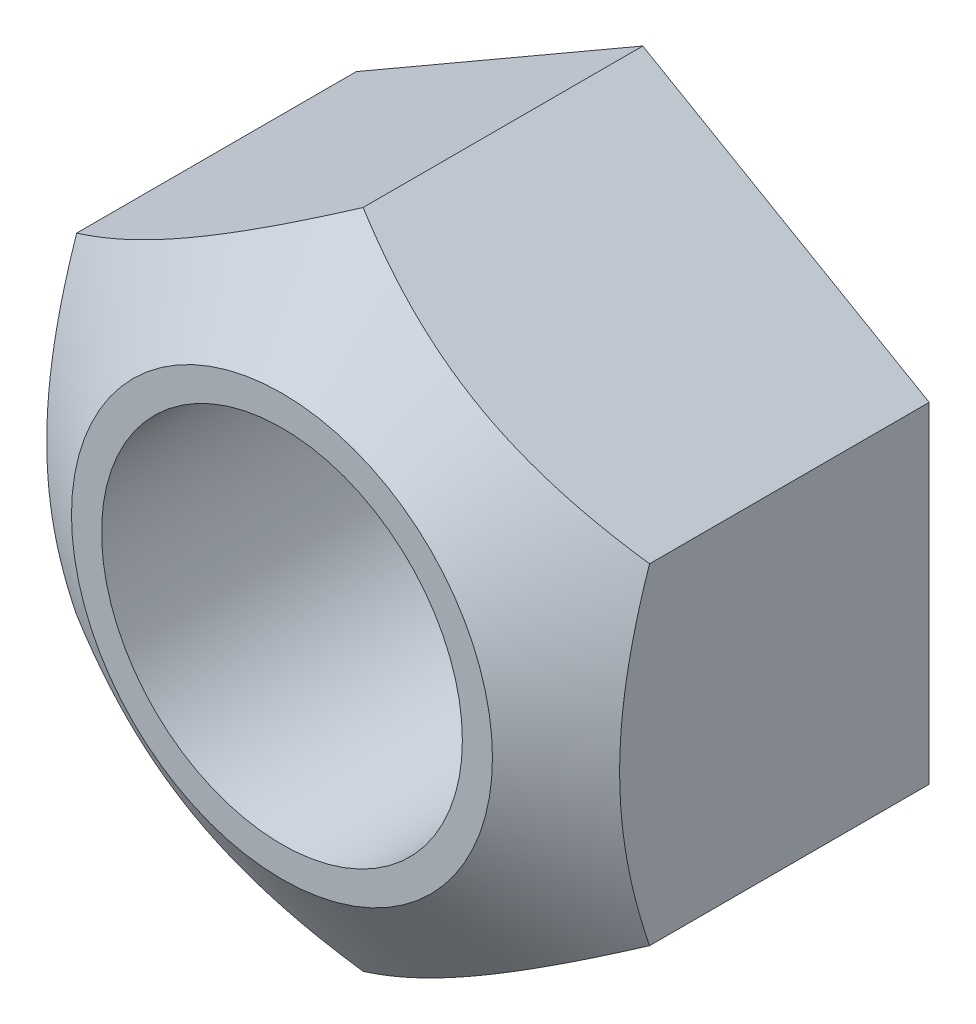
ISO-10303-21;
HEADER;
FILE_DESCRIPTION(('STEP AP214'),'2;1');
FILE_NAME('part.step','',(''),(''),'','','');
FILE_SCHEMA(('AUTOMOTIVE_DESIGN { 1 0 10303 214 1 1 1 1 }'));
ENDSEC;
DATA;
#1=APPLICATION_CONTEXT('core data for automotive mechanical design processes');
#2=APPLICATION_PROTOCOL_DEFINITION('international standard','automotive_design',2000,#1);
#3=PRODUCT_CONTEXT('',#1,'mechanical');
#4=PRODUCT('Part','Part','',(#3));
#5=PRODUCT_RELATED_PRODUCT_CATEGORY('part','',(#4));
#6=PRODUCT_DEFINITION_FORMATION('','',#4);
#7=PRODUCT_DEFINITION_CONTEXT('part definition',#1,'design');
#8=PRODUCT_DEFINITION('design','',#6,#7);
#9=PRODUCT_DEFINITION_SHAPE('','',#8);
#10=(LENGTH_UNIT() NAMED_UNIT(*) SI_UNIT(.MILLI.,.METRE.));
#11=(NAMED_UNIT(*) PLANE_ANGLE_UNIT() SI_UNIT($,.RADIAN.));
#12=(NAMED_UNIT(*) SI_UNIT($,.STERADIAN.) SOLID_ANGLE_UNIT());
#13=UNCERTAINTY_MEASURE_WITH_UNIT(LENGTH_MEASURE(1.E-05),#10,'distance_accuracy_value','');
#14=(GEOMETRIC_REPRESENTATION_CONTEXT(3) GLOBAL_UNCERTAINTY_ASSIGNED_CONTEXT((#13)) GLOBAL_UNIT_ASSIGNED_CONTEXT((#10,
#11,#12)) REPRESENTATION_CONTEXT('',''));
#15=CARTESIAN_POINT('',(0.,0.,0.));
#16=DIRECTION('',(0.,0.,1.));
#17=DIRECTION('',(1.,0.,0.));
#18=AXIS2_PLACEMENT_3D('',#15,#16,#17);
#19=CARTESIAN_POINT('',(-4.76313972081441,2.75,6.));
#20=DIRECTION('',(1.,0.,0.));
#21=DIRECTION('',(0.,1.,0.));
#22=AXIS2_PLACEMENT_3D('',#19,#20,#21);
#23=PLANE('',#22);
#24=CARTESIAN_POINT('',(-4.76313972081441,-7.2526103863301,2.50816547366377));
#25=CARTESIAN_POINT('',(-4.76313972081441,-7.05579232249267,2.61910131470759));
#26=CARTESIAN_POINT('',(-4.76313972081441,-6.85840868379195,2.72905012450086));
#27=CARTESIAN_POINT('',(-4.76313972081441,-6.46221850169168,2.9464340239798));
#28=CARTESIAN_POINT('',(-4.76313972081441,-6.26341171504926,3.0538686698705));
#29=CARTESIAN_POINT('',(-4.76313972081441,-5.86291489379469,3.26630165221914));
#30=CARTESIAN_POINT('',(-4.76313972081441,-5.66121462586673,3.37128075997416));
#31=CARTESIAN_POINT('',(-4.76313972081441,-5.25582481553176,3.57731031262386));
#32=CARTESIAN_POINT('',(-4.76313972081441,-5.05213538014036,3.67836096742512));
#33=CARTESIAN_POINT('',(-4.76313972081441,-4.63330450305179,3.87986443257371));
#34=CARTESIAN_POINT('',(-4.76313972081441,-4.4180548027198,3.98009342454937));
#35=CARTESIAN_POINT('',(-4.76313972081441,-3.98439023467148,4.17358610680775));
#36=CARTESIAN_POINT('',(-4.76313972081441,-3.76597494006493,4.2668488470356));
#37=CARTESIAN_POINT('',(-4.76313972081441,-3.3259449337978,4.44407861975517));
#38=CARTESIAN_POINT('',(-4.76313972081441,-3.1043386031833,4.52806625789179));
#39=CARTESIAN_POINT('',(-4.76313972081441,-2.65702831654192,4.68420034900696));
#40=CARTESIAN_POINT('',(-4.76313972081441,-2.43132590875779,4.75635117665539));
#41=CARTESIAN_POINT('',(-4.76313972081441,-1.96626920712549,4.88804939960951));
#42=CARTESIAN_POINT('',(-4.76313972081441,-1.72673283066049,4.94696559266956));
#43=CARTESIAN_POINT('',(-4.76313972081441,-1.24339082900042,5.04397117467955));
#44=CARTESIAN_POINT('',(-4.76313972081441,-0.999586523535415,5.08206688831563));
#45=CARTESIAN_POINT('',(-4.76313972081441,-0.634142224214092,5.12065184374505));
#46=CARTESIAN_POINT('',(-4.76313972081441,-0.513441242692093,5.13041331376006));
#47=CARTESIAN_POINT('',(-4.76313972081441,-0.271691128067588,5.14380334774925));
#48=CARTESIAN_POINT('',(-4.76313972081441,-0.150642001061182,5.14743201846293));
#49=CARTESIAN_POINT('',(-4.76313972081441,0.0914912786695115,5.14844711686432));
#50=CARTESIAN_POINT('',(-4.76313972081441,0.212575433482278,5.14583301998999));
#51=CARTESIAN_POINT('',(-4.76313972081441,0.454454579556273,5.1344376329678));
#52=CARTESIAN_POINT('',(-4.76313972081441,0.57524955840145,5.12565608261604));
#53=CARTESIAN_POINT('',(-4.76313972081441,0.832660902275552,5.1005598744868));
#54=CARTESIAN_POINT('',(-4.76313972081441,0.969193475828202,5.08338275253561));
#55=CARTESIAN_POINT('',(-4.76313972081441,1.24116256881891,5.04192243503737));
#56=CARTESIAN_POINT('',(-4.76313972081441,1.37659902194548,5.01763881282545));
#57=CARTESIAN_POINT('',(-4.76313972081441,1.78102445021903,4.93513134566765));
#58=CARTESIAN_POINT('',(-4.76313972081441,2.04807816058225,4.86725636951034));
#59=CARTESIAN_POINT('',(-4.76313972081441,2.44748376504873,4.74961951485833));
#60=CARTESIAN_POINT('',(-4.76313972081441,2.58209478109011,4.70713585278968));
#61=CARTESIAN_POINT('',(-4.76313972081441,2.84983056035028,4.61768165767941));
#62=CARTESIAN_POINT('',(-4.76313972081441,2.98295531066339,4.57071108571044));
#63=CARTESIAN_POINT('',(-4.76313972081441,3.24775159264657,4.4729471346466));
#64=CARTESIAN_POINT('',(-4.76313972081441,3.37942341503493,4.4221545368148));
#65=CARTESIAN_POINT('',(-4.76313972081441,3.6414482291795,4.31729743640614));
#66=CARTESIAN_POINT('',(-4.76313972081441,3.77180126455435,4.26323304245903));
#67=CARTESIAN_POINT('',(-4.76313972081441,4.14720788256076,4.10278645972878));
#68=CARTESIAN_POINT('',(-4.76313972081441,4.39072317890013,3.99280406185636));
#69=CARTESIAN_POINT('',(-4.76313972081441,4.87427011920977,3.76540019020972));
#70=CARTESIAN_POINT('',(-4.76313972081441,5.11430113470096,3.64797739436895));
#71=CARTESIAN_POINT('',(-4.76313972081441,5.59166544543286,3.40743225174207));
#72=CARTESIAN_POINT('',(-4.76313972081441,5.82899697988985,3.28430642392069));
#73=CARTESIAN_POINT('',(-4.76313972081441,6.30134050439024,3.03373634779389));
#74=CARTESIAN_POINT('',(-4.76313972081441,6.53635264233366,2.90629237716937));
#75=CARTESIAN_POINT('',(-4.76313972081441,7.00512000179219,2.64768980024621));
#76=CARTESIAN_POINT('',(-4.76313972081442,7.23887034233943,2.51652236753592));
#77=CARTESIAN_POINT('',(-4.76313972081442,7.70483746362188,2.25149020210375));
#78=CARTESIAN_POINT('',(-4.76313972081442,7.93705422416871,2.11762543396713));
#79=CARTESIAN_POINT('',(-4.76313972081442,8.63166210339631,1.71290597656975));
#80=CARTESIAN_POINT('',(-4.76313972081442,9.09217724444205,1.43883325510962));
#81=CARTESIAN_POINT('',(-4.76313972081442,9.95255298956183,0.919479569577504));
#82=CARTESIAN_POINT('',(-4.76313972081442,10.3528197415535,0.674867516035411));
#83=CARTESIAN_POINT('',(-4.76313972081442,11.1513944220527,0.182383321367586));
#84=CARTESIAN_POINT('',(-4.76313972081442,11.5497021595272,-0.0654891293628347));
#85=CARTESIAN_POINT('',(-4.76313972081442,12.3426833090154,-0.562328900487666));
#86=CARTESIAN_POINT('',(-4.76313972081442,12.7373647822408,-0.811283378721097));
#87=CARTESIAN_POINT('',(-4.76313972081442,13.5254887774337,-1.31104036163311));
#88=CARTESIAN_POINT('',(-4.76313972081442,13.9189314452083,-1.56184263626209));
#89=CARTESIAN_POINT('',(-4.76313972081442,14.3119350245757,-1.81332618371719));
#90=B_SPLINE_CURVE_WITH_KNOTS('',3,(#24,#25,#26,#27,#28,#29,#30,#31,#32,#33,#34,#35,#36,#37,#38,
#39,#40,#41,#42,#43,#44,#45,#46,#47,#48,#49,#50,#51,#52,#53,#54,#55,#56,#57,#58,#59,#60,#61,#62,
#63,#64,#65,#66,#67,#68,#69,#70,#71,#72,#73,#74,#75,#76,#77,#78,#79,#80,#81,#82,#83,#84,#85,#86,
#87,#88,#89),.UNSPECIFIED.,.F.,.F.,(4,2,2,2,2,2,2,2,2,2,2,2,2,2,2,2,2,2,2,2,2,2,2,2,2,2,2,2,2,2,
2,2,4),(0.,0.677797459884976,1.35571367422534,2.03783185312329,2.71991353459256,
3.43214158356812,4.14446658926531,4.85517582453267,5.56562179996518,6.30493390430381,
7.04402130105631,7.40717386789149,7.77032011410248,8.13349687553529,8.49668896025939,
8.90930236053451,9.32194053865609,10.1473710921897,10.5707919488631,10.9942164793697,
11.4175546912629,11.8408788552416,12.6422887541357,13.4438414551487,14.2458900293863,
15.0478871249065,15.8519772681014,16.6560779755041,18.2637077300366,19.6709722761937,
21.0783714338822,22.4782824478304,23.8780220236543),.UNSPECIFIED.);
#91=CARTESIAN_POINT('',(-4.76313972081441,2.75,4.65098296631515));
#92=VERTEX_POINT('',#91);
#93=CARTESIAN_POINT('',(-4.76313972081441,-2.75,4.65098296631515));
#94=VERTEX_POINT('',#93);
#95=EDGE_CURVE('E81',#92,#94,#90,.F.);
#96=ORIENTED_EDGE('',*,*,#95,.F.);
#97=DIRECTION('',(0.,0.,-1.));
#98=VECTOR('',#97,1.);
#99=CARTESIAN_POINT('',(-4.76313972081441,2.75,6.));
#100=LINE('',#99,#98);
#101=CARTESIAN_POINT('',(-4.76313972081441,2.75,0.));
#102=VERTEX_POINT('',#101);
#103=EDGE_CURVE('E51',#92,#102,#100,.T.);
#104=ORIENTED_EDGE('',*,*,#103,.T.);
#105=DIRECTION('',(0.,-1.,0.));
#106=VECTOR('',#105,1.);
#107=CARTESIAN_POINT('',(-4.76313972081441,2.75,0.));
#108=LINE('',#107,#106);
#109=CARTESIAN_POINT('',(-4.76313972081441,-2.75,0.));
#110=VERTEX_POINT('',#109);
#111=EDGE_CURVE('E121',#102,#110,#108,.T.);
#112=ORIENTED_EDGE('',*,*,#111,.T.);
#113=DIRECTION('',(0.,0.,-1.));
#114=VECTOR('',#113,1.);
#115=CARTESIAN_POINT('',(-4.76313972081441,-2.75,6.));
#116=LINE('',#115,#114);
#117=EDGE_CURVE('E11',#94,#110,#116,.T.);
#118=ORIENTED_EDGE('',*,*,#117,.F.);
#119=EDGE_LOOP('',(#96,#104,#112,#118));
#120=FACE_BOUND('',#119,.T.);
#121=ADVANCED_FACE('F28',(#120),#23,.F.);
#122=CARTESIAN_POINT('',(-4.76313972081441,-2.75,6.));
#123=DIRECTION('',(0.5,0.866025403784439,0.));
#124=DIRECTION('',(-0.866025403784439,0.5,0.));
#125=AXIS2_PLACEMENT_3D('',#122,#123,#124);
#126=PLANE('',#125);
#127=CARTESIAN_POINT('',(-4.76333972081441,-2.74988452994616,4.65090507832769));
#128=CARTESIAN_POINT('',(-4.55086848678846,-2.8725548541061,4.73369189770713));
#129=CARTESIAN_POINT('',(-4.33582389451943,-2.99671090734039,4.80912887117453));
#130=CARTESIAN_POINT('',(-3.90058164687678,-3.24799813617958,4.94064961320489));
#131=CARTESIAN_POINT('',(-3.68036849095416,-3.3751382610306,4.99666418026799));
#132=CARTESIAN_POINT('',(-3.35103166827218,-3.56528096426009,5.06145902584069));
#133=CARTESIAN_POINT('',(-3.24330675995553,-3.62747596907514,5.07968996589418));
#134=CARTESIAN_POINT('',(-3.02721261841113,-3.7522379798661,5.10993839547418));
#135=CARTESIAN_POINT('',(-2.91884346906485,-3.81480493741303,5.12195667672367));
#136=CARTESIAN_POINT('',(-2.70188950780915,-3.94006336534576,5.13942313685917));
#137=CARTESIAN_POINT('',(-2.59330537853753,-4.00275444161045,5.14488248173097));
#138=CARTESIAN_POINT('',(-2.37605048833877,-4.12818661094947,5.14911350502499));
#139=CARTESIAN_POINT('',(-2.26737973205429,-4.19092770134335,5.14788552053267));
#140=CARTESIAN_POINT('',(-1.97760483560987,-4.35822931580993,5.1357007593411));
#141=CARTESIAN_POINT('',(-1.79666774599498,-4.46269339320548,5.11878632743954));
#142=CARTESIAN_POINT('',(-1.43645946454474,-4.67065974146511,5.06765068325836));
#143=CARTESIAN_POINT('',(-1.25719073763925,-4.77416058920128,5.0334070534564));
#144=CARTESIAN_POINT('',(-0.896108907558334,-4.98263128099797,4.94874745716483));
#145=CARTESIAN_POINT('',(-0.714376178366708,-5.08755472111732,4.89788522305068));
#146=CARTESIAN_POINT('',(-0.354486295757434,-5.29533724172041,4.78331385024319));
#147=CARTESIAN_POINT('',(-0.17632068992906,-5.39820120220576,4.71964039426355));
#148=CARTESIAN_POINT('',(0.000200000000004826,-5.50011547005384,4.65090507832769));
#149=B_SPLINE_CURVE_WITH_KNOTS('',3,(#127,#128,#129,#130,#131,#132,#133,#134,#135,#136,#137,
#138,#139,#140,#141,#142,#143,#144,#145,#146,#147,#148),.UNSPECIFIED.,.F.,.F.,(4,2,2,2,2,2,2,2,
2,2,4),(0.,0.777427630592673,1.55759741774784,1.93461038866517,2.3115753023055,2.68789755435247,
3.06420083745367,3.69219010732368,4.32099384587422,4.96830216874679,5.61383191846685),.UNSPECIFIED.);
#150=CARTESIAN_POINT('',(0.,-5.5,4.65098296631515));
#151=VERTEX_POINT('',#150);
#152=EDGE_CURVE('E89',#94,#151,#149,.T.);
#153=ORIENTED_EDGE('',*,*,#152,.F.);
#154=ORIENTED_EDGE('',*,*,#117,.T.);
#155=DIRECTION('',(0.866025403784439,-0.5,0.));
#156=VECTOR('',#155,1.);
#157=CARTESIAN_POINT('',(-4.76313972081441,-2.75,0.));
#158=LINE('',#157,#156);
#159=CARTESIAN_POINT('',(0.,-5.5,0.));
#160=VERTEX_POINT('',#159);
#161=EDGE_CURVE('E118',#110,#160,#158,.T.);
#162=ORIENTED_EDGE('',*,*,#161,.T.);
#163=DIRECTION('',(0.,0.,-1.));
#164=VECTOR('',#163,1.);
#165=CARTESIAN_POINT('',(0.,-5.5,6.));
#166=LINE('',#165,#164);
#167=EDGE_CURVE('E36',#151,#160,#166,.T.);
#168=ORIENTED_EDGE('',*,*,#167,.F.);
#169=EDGE_LOOP('',(#153,#154,#162,#168));
#170=FACE_BOUND('',#169,.T.);
#171=ADVANCED_FACE('F119',(#170),#126,.F.);
#172=CARTESIAN_POINT('',(0.,-5.5,6.));
#173=DIRECTION('',(-0.5,0.866025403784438,0.));
#174=DIRECTION('',(-0.866025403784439,-0.5,0.));
#175=AXIS2_PLACEMENT_3D('',#172,#173,#174);
#176=PLANE('',#175);
#177=CARTESIAN_POINT('',(-0.000199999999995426,-5.50011547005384,4.65090507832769));
#178=CARTESIAN_POINT('',(0.21227123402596,-5.3774451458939,4.73369189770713));
#179=CARTESIAN_POINT('',(0.427315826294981,-5.25328909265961,4.80912887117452));
#180=CARTESIAN_POINT('',(0.862558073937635,-5.00200186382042,4.94064961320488));
#181=CARTESIAN_POINT('',(1.08277122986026,-4.8748617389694,4.99666418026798));
#182=CARTESIAN_POINT('',(1.41210805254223,-4.68471903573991,5.06145902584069));
#183=CARTESIAN_POINT('',(1.51983296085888,-4.62252403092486,5.07968996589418));
#184=CARTESIAN_POINT('',(1.73592710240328,-4.4977620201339,5.10993839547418));
#185=CARTESIAN_POINT('',(1.84429625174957,-4.43519506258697,5.12195667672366));
#186=CARTESIAN_POINT('',(2.06125021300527,-4.30993663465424,5.13942313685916));
#187=CARTESIAN_POINT('',(2.16983434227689,-4.24724555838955,5.14488248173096));
#188=CARTESIAN_POINT('',(2.38708923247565,-4.12181338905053,5.14911350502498));
#189=CARTESIAN_POINT('',(2.49575998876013,-4.05907229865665,5.14788552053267));
#190=CARTESIAN_POINT('',(2.78553488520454,-3.89177068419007,5.1357007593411));
#191=CARTESIAN_POINT('',(2.96647197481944,-3.78730660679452,5.11878632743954));
#192=CARTESIAN_POINT('',(3.32668025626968,-3.57934025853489,5.06765068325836));
#193=CARTESIAN_POINT('',(3.50594898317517,-3.47583941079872,5.0334070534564));
#194=CARTESIAN_POINT('',(3.86703081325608,-3.26736871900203,4.94874745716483));
#195=CARTESIAN_POINT('',(4.0487635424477,-3.16244527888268,4.89788522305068));
#196=CARTESIAN_POINT('',(4.40865342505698,-2.95466275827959,4.78331385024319));
#197=CARTESIAN_POINT('',(4.58681903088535,-2.85179879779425,4.71964039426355));
#198=CARTESIAN_POINT('',(4.76333972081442,-2.74988452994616,4.65090507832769));
#199=B_SPLINE_CURVE_WITH_KNOTS('',3,(#177,#178,#179,#180,#181,#182,#183,#184,#185,#186,#187,
#188,#189,#190,#191,#192,#193,#194,#195,#196,#197,#198),.UNSPECIFIED.,.F.,.F.,(4,2,2,2,2,2,2,2,
2,2,4),(0.,0.777427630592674,1.55759741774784,1.93461038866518,2.3115753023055,2.68789755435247,
3.06420083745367,3.69219010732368,4.32099384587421,4.96830216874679,5.61383191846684),.UNSPECIFIED.);
#200=CARTESIAN_POINT('',(4.76313972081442,-2.75000000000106,4.65098296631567));
#201=VERTEX_POINT('',#200);
#202=EDGE_CURVE('E115',#151,#201,#199,.T.);
#203=ORIENTED_EDGE('',*,*,#202,.F.);
#204=ORIENTED_EDGE('',*,*,#167,.T.);
#205=DIRECTION('',(0.866025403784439,0.5,0.));
#206=VECTOR('',#205,1.);
#207=CARTESIAN_POINT('',(0.,-5.5,0.));
#208=LINE('',#207,#206);
#209=CARTESIAN_POINT('',(4.76313972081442,-2.75,0.));
#210=VERTEX_POINT('',#209);
#211=EDGE_CURVE('E113',#160,#210,#208,.T.);
#212=ORIENTED_EDGE('',*,*,#211,.T.);
#213=DIRECTION('',(0.,0.,-1.));
#214=VECTOR('',#213,1.);
#215=CARTESIAN_POINT('',(4.76313972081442,-2.75,6.));
#216=LINE('',#215,#214);
#217=EDGE_CURVE('E104',#201,#210,#216,.T.);
#218=ORIENTED_EDGE('',*,*,#217,.F.);
#219=EDGE_LOOP('',(#203,#204,#212,#218));
#220=FACE_BOUND('',#219,.T.);
#221=ADVANCED_FACE('F110',(#220),#176,.F.);
#222=CARTESIAN_POINT('',(4.76313972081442,-2.75,6.));
#223=DIRECTION('',(-1.,0.,0.));
#224=DIRECTION('',(0.,-1.,0.));
#225=AXIS2_PLACEMENT_3D('',#222,#223,#224);
#226=PLANE('',#225);
#227=CARTESIAN_POINT('',(4.76313972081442,-7.25261038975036,2.50816547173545));
#228=CARTESIAN_POINT('',(4.76313972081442,-7.05579232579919,2.61910131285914));
#229=CARTESIAN_POINT('',(4.76313972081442,-6.8584086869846,2.72905012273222));
#230=CARTESIAN_POINT('',(4.76313972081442,-6.46221850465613,2.94643402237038));
#231=CARTESIAN_POINT('',(4.76313972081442,-6.26341171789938,3.05386866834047));
#232=CARTESIAN_POINT('',(4.76313972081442,-5.8629148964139,3.26630165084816));
#233=CARTESIAN_POINT('',(4.76313972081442,-5.66121462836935,3.3712807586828));
#234=CARTESIAN_POINT('',(4.76313972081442,-5.25582481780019,3.57731031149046));
#235=CARTESIAN_POINT('',(4.76313972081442,-5.05213538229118,3.67836096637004));
#236=CARTESIAN_POINT('',(4.76313972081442,-4.63330450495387,3.87986443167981));
#237=CARTESIAN_POINT('',(4.76313972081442,-4.41805480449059,3.98009342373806));
#238=CARTESIAN_POINT('',(4.76313972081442,-3.98439023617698,4.17358610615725));
#239=CARTESIAN_POINT('',(4.76313972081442,-3.76597494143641,4.26684884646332));
#240=CARTESIAN_POINT('',(4.76313972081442,-3.32594493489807,4.44407861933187));
#241=CARTESIAN_POINT('',(4.76313972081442,-3.10433860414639,4.52806625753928));
#242=CARTESIAN_POINT('',(4.76313972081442,-2.65702831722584,4.68420034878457));
#243=CARTESIAN_POINT('',(4.76313972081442,-2.43132590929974,4.75635117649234));
#244=CARTESIAN_POINT('',(4.76313972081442,-1.96626920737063,4.88804939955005));
#245=CARTESIAN_POINT('',(4.76313972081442,-1.72673283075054,4.94696559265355));
#246=CARTESIAN_POINT('',(4.76313972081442,-1.24339082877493,5.04397117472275));
#247=CARTESIAN_POINT('',(4.76313972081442,-0.999586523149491,5.08206688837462));
#248=CARTESIAN_POINT('',(4.76313972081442,-0.634142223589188,5.12065184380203));
#249=CARTESIAN_POINT('',(4.76313972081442,-0.51344124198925,5.13041331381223));
#250=CARTESIAN_POINT('',(4.76313972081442,-0.271691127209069,5.14380334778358));
#251=CARTESIAN_POINT('',(4.76313972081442,-0.150642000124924,5.14743201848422));
#252=CARTESIAN_POINT('',(4.76313972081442,0.0914912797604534,5.14844711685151));
#253=CARTESIAN_POINT('',(4.76313972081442,0.212575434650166,5.14583301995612));
#254=CARTESIAN_POINT('',(4.76313972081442,0.454454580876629,5.13443763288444));
#255=CARTESIAN_POINT('',(4.76313972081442,0.575249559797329,5.12565608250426));
#256=CARTESIAN_POINT('',(4.76313972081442,0.832660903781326,5.10055987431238));
#257=CARTESIAN_POINT('',(4.76313972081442,0.969193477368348,5.08338275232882));
#258=CARTESIAN_POINT('',(4.76313972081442,1.24116257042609,5.04192243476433));
#259=CARTESIAN_POINT('',(4.76313972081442,1.37659902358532,5.01763881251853));
#260=CARTESIAN_POINT('',(4.76313972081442,1.78102445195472,4.93513134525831));
#261=CARTESIAN_POINT('',(4.76313972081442,2.04807816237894,4.86725636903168));
#262=CARTESIAN_POINT('',(4.76313972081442,2.4474837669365,4.74961951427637));
#263=CARTESIAN_POINT('',(4.76313972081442,2.58209478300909,4.70713585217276));
#264=CARTESIAN_POINT('',(4.76313972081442,2.84983056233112,4.61768165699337));
#265=CARTESIAN_POINT('',(4.76313972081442,2.98295531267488,4.57071108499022));
#266=CARTESIAN_POINT('',(4.76313972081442,3.24775159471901,4.472947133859));
#267=CARTESIAN_POINT('',(4.76313972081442,3.37942341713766,4.42215453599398));
#268=CARTESIAN_POINT('',(4.76313972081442,3.64144823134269,4.31729743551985));
#269=CARTESIAN_POINT('',(4.76313972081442,3.77180126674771,4.26323304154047));
#270=CARTESIAN_POINT('',(4.76313972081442,4.1472078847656,4.10278645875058));
#271=CARTESIAN_POINT('',(4.76313972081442,4.39072318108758,3.99280406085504));
#272=CARTESIAN_POINT('',(4.76313972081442,4.87427012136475,3.7654001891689));
#273=CARTESIAN_POINT('',(4.76313972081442,5.11430113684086,3.64797739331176));
#274=CARTESIAN_POINT('',(4.76313972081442,5.59166544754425,3.40743225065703));
#275=CARTESIAN_POINT('',(4.76313972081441,5.82899698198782,3.28430642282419));
#276=CARTESIAN_POINT('',(4.76313972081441,6.30134050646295,3.03373634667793));
#277=CARTESIAN_POINT('',(4.76313972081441,6.53635264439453,2.9062923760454));
#278=CARTESIAN_POINT('',(4.76313972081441,7.00512000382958,2.64768979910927));
#279=CARTESIAN_POINT('',(4.76313972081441,7.23887034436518,2.51652236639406));
#280=CARTESIAN_POINT('',(4.76313972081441,7.70483746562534,2.25149020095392));
#281=CARTESIAN_POINT('',(4.76313972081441,7.9370542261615,2.11762543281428));
#282=CARTESIAN_POINT('',(4.76313972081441,8.63166210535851,1.71290597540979));
#283=CARTESIAN_POINT('',(4.76313972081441,9.09217724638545,1.43883325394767));
#284=CARTESIAN_POINT('',(4.76313972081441,9.952552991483,0.91947956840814));
#285=CARTESIAN_POINT('',(4.76313972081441,10.3528197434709,0.674867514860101));
#286=CARTESIAN_POINT('',(4.76313972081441,11.1513944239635,0.182383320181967));
#287=CARTESIAN_POINT('',(4.76313972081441,11.5497021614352,-0.0654891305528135));
#288=CARTESIAN_POINT('',(4.76313972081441,12.3426833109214,-0.562328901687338));
#289=CARTESIAN_POINT('',(4.76313972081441,12.7373647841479,-0.811283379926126));
#290=CARTESIAN_POINT('',(4.76313972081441,13.5254887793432,-1.31104036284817));
#291=CARTESIAN_POINT('',(4.76313972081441,13.9189314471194,-1.56184263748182));
#292=CARTESIAN_POINT('',(4.76313972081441,14.3119350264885,-1.81332618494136));
#293=B_SPLINE_CURVE_WITH_KNOTS('',3,(#227,#228,#229,#230,#231,#232,#233,#234,#235,#236,#237,
#238,#239,#240,#241,#242,#243,#244,#245,#246,#247,#248,#249,#250,#251,#252,#253,#254,#255,#256,
#257,#258,#259,#260,#261,#262,#263,#264,#265,#266,#267,#268,#269,#270,#271,#272,#273,#274,#275,
#276,#277,#278,#279,#280,#281,#282,#283,#284,#285,#286,#287,#288,#289,#290,#291,#292),
.UNSPECIFIED.,.F.,.F.,(4,2,2,2,2,2,2,2,2,2,2,2,2,2,2,2,2,2,2,2,2,2,2,2,2,2,2,2,2,2,2,2,4),(0.,
0.67779746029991,1.35571367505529,2.03783185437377,2.71991353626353,3.43214158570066,
4.14446659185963,4.85517582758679,5.56562180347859,6.30493390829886,7.04402130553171,
7.4071738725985,7.7703201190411,8.13349688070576,8.49668896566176,8.90930236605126,
9.32194054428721,10.1473710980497,10.570791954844,10.9942164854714,11.4175546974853,
11.8408788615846,12.6422887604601,13.4438414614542,14.245890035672,15.0478871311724,
15.8519772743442,16.6560779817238,18.2637077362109,19.6709722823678,21.0783714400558,
22.4782824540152,23.8780220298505),.UNSPECIFIED.);
#294=CARTESIAN_POINT('',(4.76313972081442,2.75,4.65098296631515));
#295=VERTEX_POINT('',#294);
#296=EDGE_CURVE('E170',#201,#295,#293,.T.);
#297=ORIENTED_EDGE('',*,*,#296,.F.);
#298=ORIENTED_EDGE('',*,*,#217,.T.);
#299=DIRECTION('',(0.,1.,0.));
#300=VECTOR('',#299,1.);
#301=CARTESIAN_POINT('',(4.76313972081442,-2.75,0.));
#302=LINE('',#301,#300);
#303=CARTESIAN_POINT('',(4.76313972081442,2.75,0.));
#304=VERTEX_POINT('',#303);
#305=EDGE_CURVE('E126',#210,#304,#302,.T.);
#306=ORIENTED_EDGE('',*,*,#305,.T.);
#307=DIRECTION('',(0.,0.,-1.));
#308=VECTOR('',#307,1.);
#309=CARTESIAN_POINT('',(4.76313972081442,2.75,6.));
#310=LINE('',#309,#308);
#311=EDGE_CURVE('E97',#295,#304,#310,.T.);
#312=ORIENTED_EDGE('',*,*,#311,.F.);
#313=EDGE_LOOP('',(#297,#298,#306,#312));
#314=FACE_BOUND('',#313,.T.);
#315=ADVANCED_FACE('F181',(#314),#226,.F.);
#316=CARTESIAN_POINT('',(4.76313972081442,2.75,6.));
#317=DIRECTION('',(-0.5,-0.866025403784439,0.));
#318=DIRECTION('',(0.866025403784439,-0.5,0.));
#319=AXIS2_PLACEMENT_3D('',#316,#317,#318);
#320=PLANE('',#319);
#321=CARTESIAN_POINT('',(4.76333972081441,2.74988452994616,4.65090507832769));
#322=CARTESIAN_POINT('',(4.55086848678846,2.8725548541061,4.73369189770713));
#323=CARTESIAN_POINT('',(4.33582389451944,2.9967109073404,4.80912887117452));
#324=CARTESIAN_POINT('',(3.90058164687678,3.24799813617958,4.94064961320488));
#325=CARTESIAN_POINT('',(3.68036849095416,3.3751382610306,4.99666418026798));
#326=CARTESIAN_POINT('',(3.35103166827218,3.5652809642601,5.06145902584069));
#327=CARTESIAN_POINT('',(3.24330675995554,3.62747596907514,5.07968996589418));
#328=CARTESIAN_POINT('',(3.02721261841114,3.7522379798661,5.10993839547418));
#329=CARTESIAN_POINT('',(2.91884346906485,3.81480493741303,5.12195667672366));
#330=CARTESIAN_POINT('',(2.70188950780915,3.94006336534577,5.13942313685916));
#331=CARTESIAN_POINT('',(2.59330537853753,4.00275444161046,5.14488248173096));
#332=CARTESIAN_POINT('',(2.37605048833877,4.12818661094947,5.14911350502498));
#333=CARTESIAN_POINT('',(2.26737973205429,4.19092770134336,5.14788552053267));
#334=CARTESIAN_POINT('',(1.97760483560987,4.35822931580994,5.1357007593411));
#335=CARTESIAN_POINT('',(1.79666774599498,4.46269339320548,5.11878632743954));
#336=CARTESIAN_POINT('',(1.43645946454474,4.67065974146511,5.06765068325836));
#337=CARTESIAN_POINT('',(1.25719073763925,4.77416058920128,5.0334070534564));
#338=CARTESIAN_POINT('',(0.896108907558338,4.98263128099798,4.94874745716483));
#339=CARTESIAN_POINT('',(0.714376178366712,5.08755472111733,4.89788522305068));
#340=CARTESIAN_POINT('',(0.354486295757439,5.29533724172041,4.78331385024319));
#341=CARTESIAN_POINT('',(0.176320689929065,5.39820120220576,4.71964039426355));
#342=CARTESIAN_POINT('',(-0.000199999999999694,5.50011547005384,4.65090507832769));
#343=B_SPLINE_CURVE_WITH_KNOTS('',3,(#321,#322,#323,#324,#325,#326,#327,#328,#329,#330,#331,
#332,#333,#334,#335,#336,#337,#338,#339,#340,#341,#342),.UNSPECIFIED.,.F.,.F.,(4,2,2,2,2,2,2,2,
2,2,4),(0.,0.777427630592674,1.55759741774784,1.93461038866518,2.3115753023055,2.68789755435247,
3.06420083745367,3.69219010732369,4.32099384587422,4.96830216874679,5.61383191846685),.UNSPECIFIED.);
#344=CARTESIAN_POINT('',(0.,5.5,4.65098296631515));
#345=VERTEX_POINT('',#344);
#346=EDGE_CURVE('E43',#295,#345,#343,.T.);
#347=ORIENTED_EDGE('',*,*,#346,.F.);
#348=ORIENTED_EDGE('',*,*,#311,.T.);
#349=DIRECTION('',(-0.866025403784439,0.5,0.));
#350=VECTOR('',#349,1.);
#351=CARTESIAN_POINT('',(4.76313972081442,2.75,0.));
#352=LINE('',#351,#350);
#353=CARTESIAN_POINT('',(0.,5.5,0.));
#354=VERTEX_POINT('',#353);
#355=EDGE_CURVE('E99',#304,#354,#352,.T.);
#356=ORIENTED_EDGE('',*,*,#355,.T.);
#357=DIRECTION('',(0.,0.,-1.));
#358=VECTOR('',#357,1.);
#359=CARTESIAN_POINT('',(0.,5.5,6.));
#360=LINE('',#359,#358);
#361=EDGE_CURVE('E95',#345,#354,#360,.T.);
#362=ORIENTED_EDGE('',*,*,#361,.F.);
#363=EDGE_LOOP('',(#347,#348,#356,#362));
#364=FACE_BOUND('',#363,.T.);
#365=ADVANCED_FACE('F132',(#364),#320,.F.);
#366=CARTESIAN_POINT('',(0.,5.5,6.));
#367=DIRECTION('',(0.5,-0.866025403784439,0.));
#368=DIRECTION('',(0.866025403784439,0.5,0.));
#369=AXIS2_PLACEMENT_3D('',#366,#367,#368);
#370=PLANE('',#369);
#371=CARTESIAN_POINT('',(0.00020000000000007,5.50011547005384,4.65090507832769));
#372=CARTESIAN_POINT('',(-0.212271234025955,5.3774451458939,4.73369189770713));
#373=CARTESIAN_POINT('',(-0.427315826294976,5.25328909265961,4.80912887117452));
#374=CARTESIAN_POINT('',(-0.862558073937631,5.00200186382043,4.94064961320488));
#375=CARTESIAN_POINT('',(-1.08277122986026,4.8748617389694,4.99666418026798));
#376=CARTESIAN_POINT('',(-1.41210805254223,4.68471903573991,5.06145902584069));
#377=CARTESIAN_POINT('',(-1.51983296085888,4.62252403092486,5.07968996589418));
#378=CARTESIAN_POINT('',(-1.73592710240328,4.4977620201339,5.10993839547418));
#379=CARTESIAN_POINT('',(-1.84429625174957,4.43519506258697,5.12195667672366));
#380=CARTESIAN_POINT('',(-2.06125021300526,4.30993663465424,5.13942313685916));
#381=CARTESIAN_POINT('',(-2.16983434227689,4.24724555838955,5.14488248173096));
#382=CARTESIAN_POINT('',(-2.38708923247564,4.12181338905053,5.14911350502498));
#383=CARTESIAN_POINT('',(-2.49575998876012,4.05907229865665,5.14788552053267));
#384=CARTESIAN_POINT('',(-2.78553488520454,3.89177068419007,5.1357007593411));
#385=CARTESIAN_POINT('',(-2.96647197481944,3.78730660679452,5.11878632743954));
#386=CARTESIAN_POINT('',(-3.32668025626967,3.57934025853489,5.06765068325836));
#387=CARTESIAN_POINT('',(-3.50594898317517,3.47583941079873,5.0334070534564));
#388=CARTESIAN_POINT('',(-3.86703081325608,3.26736871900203,4.94874745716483));
#389=CARTESIAN_POINT('',(-4.0487635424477,3.16244527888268,4.89788522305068));
#390=CARTESIAN_POINT('',(-4.40865342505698,2.95466275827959,4.78331385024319));
#391=CARTESIAN_POINT('',(-4.58681903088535,2.85179879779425,4.71964039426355));
#392=CARTESIAN_POINT('',(-4.76333972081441,2.74988452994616,4.65090507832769));
#393=B_SPLINE_CURVE_WITH_KNOTS('',3,(#371,#372,#373,#374,#375,#376,#377,#378,#379,#380,#381,
#382,#383,#384,#385,#386,#387,#388,#389,#390,#391,#392),.UNSPECIFIED.,.F.,.F.,(4,2,2,2,2,2,2,2,
2,2,4),(0.,0.777427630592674,1.55759741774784,1.93461038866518,2.3115753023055,2.68789755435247,
3.06420083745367,3.69219010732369,4.32099384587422,4.96830216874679,5.61383191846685),.UNSPECIFIED.);
#394=EDGE_CURVE('E79',#345,#92,#393,.T.);
#395=ORIENTED_EDGE('',*,*,#394,.F.);
#396=ORIENTED_EDGE('',*,*,#361,.T.);
#397=DIRECTION('',(-0.866025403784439,-0.5,0.));
#398=VECTOR('',#397,1.);
#399=CARTESIAN_POINT('',(0.,5.5,0.));
#400=LINE('',#399,#398);
#401=EDGE_CURVE('E93',#354,#102,#400,.T.);
#402=ORIENTED_EDGE('',*,*,#401,.T.);
#403=ORIENTED_EDGE('',*,*,#103,.F.);
#404=EDGE_LOOP('',(#395,#396,#402,#403));
#405=FACE_BOUND('',#404,.T.);
#406=ADVANCED_FACE('F91',(#405),#370,.F.);
#407=CARTESIAN_POINT('',(-4.76313972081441,2.75,6.));
#408=DIRECTION('',(0.,0.,-1.));
#409=DIRECTION('',(-1.,0.,0.));
#410=AXIS2_PLACEMENT_3D('',#407,#408,#409);
#411=PLANE('',#410);
#412=CARTESIAN_POINT('',(0.,0.,6.));
#413=DIRECTION('',(0.,0.,1.));
#414=DIRECTION('',(1.,0.,0.));
#415=AXIS2_PLACEMENT_3D('',#412,#413,#414);
#416=CIRCLE('',#415,3.);
#417=CARTESIAN_POINT('',(3.,0.,6.));
#418=VERTEX_POINT('',#417);
#419=EDGE_CURVE('E88',#418,#418,#416,.T.);
#420=ORIENTED_EDGE('',*,*,#419,.F.);
#421=EDGE_LOOP('',(#420));
#422=FACE_BOUND('',#421,.T.);
#423=CARTESIAN_POINT('',(0.,0.,6.));
#424=DIRECTION('',(0.,0.,1.));
#425=DIRECTION('',(1.,0.,0.));
#426=AXIS2_PLACEMENT_3D('',#423,#424,#425);
#427=CIRCLE('',#426,3.5);
#428=CARTESIAN_POINT('',(3.5,0.,6.));
#429=VERTEX_POINT('',#428);
#430=EDGE_CURVE('E85',#429,#429,#427,.T.);
#431=ORIENTED_EDGE('',*,*,#430,.T.);
#432=EDGE_LOOP('',(#431));
#433=FACE_BOUND('',#432,.T.);
#434=ADVANCED_FACE('F230',(#422,#433),#411,.F.);
#435=CARTESIAN_POINT('',(-4.76313972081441,2.75,0.));
#436=DIRECTION('',(0.,0.,-1.));
#437=DIRECTION('',(-1.,0.,0.));
#438=AXIS2_PLACEMENT_3D('',#435,#436,#437);
#439=PLANE('',#438);
#440=CARTESIAN_POINT('',(0.,0.,0.));
#441=DIRECTION('',(0.,0.,1.));
#442=DIRECTION('',(1.,0.,0.));
#443=AXIS2_PLACEMENT_3D('',#440,#441,#442);
#444=CIRCLE('',#443,3.);
#445=CARTESIAN_POINT('',(3.,0.,0.));
#446=VERTEX_POINT('',#445);
#447=EDGE_CURVE('E134',#446,#446,#444,.T.);
#448=ORIENTED_EDGE('',*,*,#447,.T.);
#449=EDGE_LOOP('',(#448));
#450=FACE_BOUND('',#449,.T.);
#451=ORIENTED_EDGE('',*,*,#111,.F.);
#452=ORIENTED_EDGE('',*,*,#401,.F.);
#453=ORIENTED_EDGE('',*,*,#355,.F.);
#454=ORIENTED_EDGE('',*,*,#305,.F.);
#455=ORIENTED_EDGE('',*,*,#211,.F.);
#456=ORIENTED_EDGE('',*,*,#161,.F.);
#457=EDGE_LOOP('',(#451,#452,#453,#454,#455,#456));
#458=FACE_BOUND('',#457,.T.);
#459=ADVANCED_FACE('F123',(#450,#458),#439,.T.);
#460=CARTESIAN_POINT('',(0.,0.,0.));
#461=DIRECTION('',(0.,0.,1.));
#462=DIRECTION('',(1.,0.,0.));
#463=AXIS2_PLACEMENT_3D('',#460,#461,#462);
#464=CYLINDRICAL_SURFACE('',#463,3.);
#465=ORIENTED_EDGE('',*,*,#447,.F.);
#466=EDGE_LOOP('',(#465));
#467=FACE_BOUND('',#466,.T.);
#468=ORIENTED_EDGE('',*,*,#419,.T.);
#469=EDGE_LOOP('',(#468));
#470=FACE_BOUND('',#469,.T.);
#471=ADVANCED_FACE('F151',(#467,#470),#464,.F.);
#472=CARTESIAN_POINT('',(0.,0.,6.));
#473=DIRECTION('',(0.,0.,-1.));
#474=DIRECTION('',(1.,0.,0.));
#475=AXIS2_PLACEMENT_3D('',#472,#473,#474);
#476=CONICAL_SURFACE('',#475,3.5,0.977384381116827);
#477=ORIENTED_EDGE('',*,*,#430,.F.);
#478=EDGE_LOOP('',(#477));
#479=FACE_BOUND('',#478,.T.);
#480=ORIENTED_EDGE('',*,*,#95,.T.);
#481=ORIENTED_EDGE('',*,*,#152,.T.);
#482=ORIENTED_EDGE('',*,*,#202,.T.);
#483=ORIENTED_EDGE('',*,*,#296,.T.);
#484=ORIENTED_EDGE('',*,*,#346,.T.);
#485=ORIENTED_EDGE('',*,*,#394,.T.);
#486=EDGE_LOOP('',(#480,#481,#482,#483,#484,#485));
#487=FACE_BOUND('',#486,.T.);
#488=ADVANCED_FACE('F80',(#479,#487),#476,.T.);
#489=CLOSED_SHELL('',(#121,#171,#221,#315,#365,#406,#434,#459,#471,#488));
#490=MANIFOLD_SOLID_BREP('B2',#489);
#491=ADVANCED_BREP_SHAPE_REPRESENTATION('',(#18,#490),#14);
#492=SHAPE_DEFINITION_REPRESENTATION(#9,#491);
ENDSEC;
END-ISO-10303-21;
